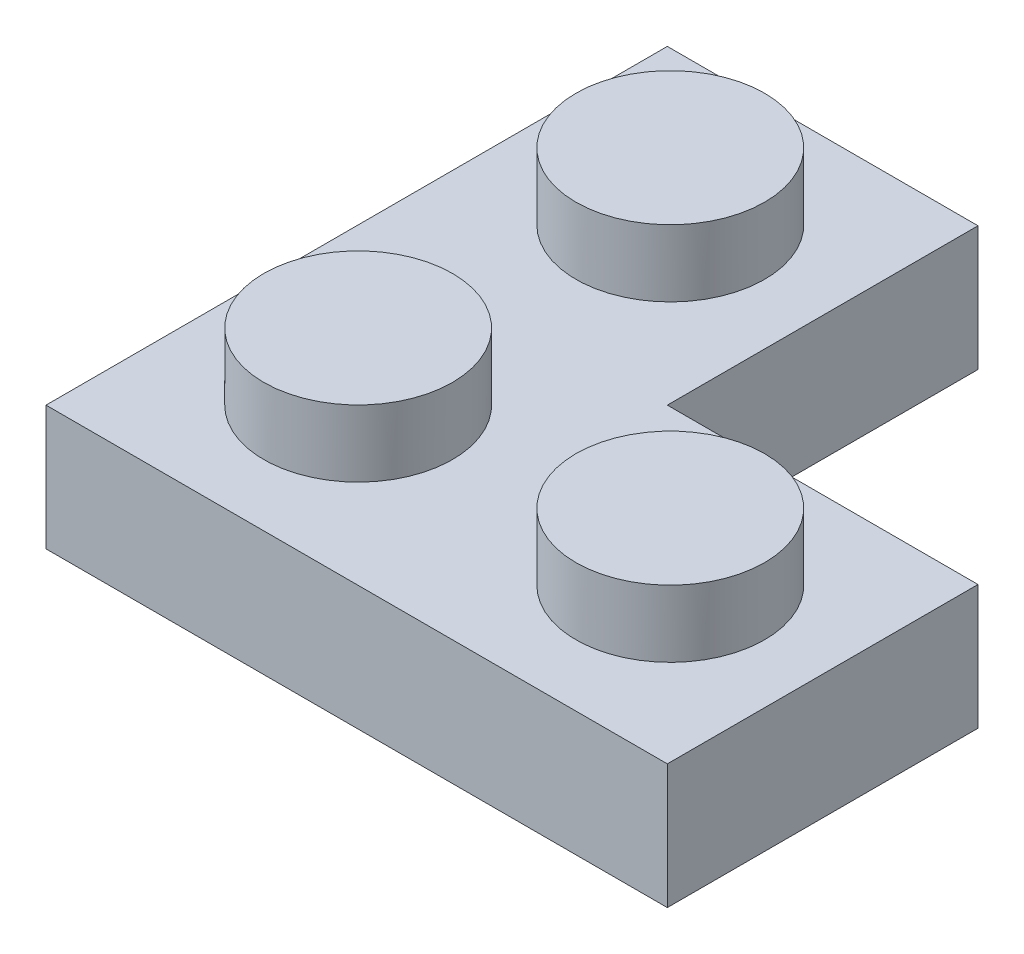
ISO-10303-21;
HEADER;
FILE_DESCRIPTION(('STEP AP214'),'2;1');
FILE_NAME('part.step','',(''),(''),'','','');
FILE_SCHEMA(('AUTOMOTIVE_DESIGN { 1 0 10303 214 1 1 1 1 }'));
ENDSEC;
DATA;
#1=APPLICATION_CONTEXT('core data for automotive mechanical design processes');
#2=APPLICATION_PROTOCOL_DEFINITION('international standard','automotive_design',2000,#1);
#3=PRODUCT_CONTEXT('',#1,'mechanical');
#4=PRODUCT('Part','Part','',(#3));
#5=PRODUCT_RELATED_PRODUCT_CATEGORY('part','',(#4));
#6=PRODUCT_DEFINITION_FORMATION('','',#4);
#7=PRODUCT_DEFINITION_CONTEXT('part definition',#1,'design');
#8=PRODUCT_DEFINITION('design','',#6,#7);
#9=PRODUCT_DEFINITION_SHAPE('','',#8);
#10=(LENGTH_UNIT() NAMED_UNIT(*) SI_UNIT(.MILLI.,.METRE.));
#11=(NAMED_UNIT(*) PLANE_ANGLE_UNIT() SI_UNIT($,.RADIAN.));
#12=(NAMED_UNIT(*) SI_UNIT($,.STERADIAN.) SOLID_ANGLE_UNIT());
#13=UNCERTAINTY_MEASURE_WITH_UNIT(LENGTH_MEASURE(1.E-05),#10,'distance_accuracy_value','');
#14=(GEOMETRIC_REPRESENTATION_CONTEXT(3) GLOBAL_UNCERTAINTY_ASSIGNED_CONTEXT((#13)) GLOBAL_UNIT_ASSIGNED_CONTEXT((#10,
#11,#12)) REPRESENTATION_CONTEXT('',''));
#15=CARTESIAN_POINT('',(0.,0.,0.));
#16=DIRECTION('',(0.,0.,1.));
#17=DIRECTION('',(1.,0.,0.));
#18=AXIS2_PLACEMENT_3D('',#15,#16,#17);
#19=CARTESIAN_POINT('',(-7.9,1.5785,7.9));
#20=DIRECTION('',(0.,-1.,0.));
#21=DIRECTION('',(0.,0.,-1.));
#22=AXIS2_PLACEMENT_3D('',#19,#20,#21);
#23=PLANE('',#22);
#24=CARTESIAN_POINT('',(-3.81000000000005,1.5785,0.));
#25=DIRECTION('',(0.,-1.,0.));
#26=DIRECTION('',(0.,0.,-1.));
#27=AXIS2_PLACEMENT_3D('',#24,#25,#26);
#28=CIRCLE('',#27,1.27);
#29=CARTESIAN_POINT('',(-3.81000000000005,1.5785,-1.27));
#30=VERTEX_POINT('',#29);
#31=EDGE_CURVE('E396',#30,#30,#28,.T.);
#32=ORIENTED_EDGE('',*,*,#31,.F.);
#33=EDGE_LOOP('',(#32));
#34=FACE_BOUND('',#33,.T.);
#35=CARTESIAN_POINT('',(-3.93125,1.5785,-4.00625));
#36=DIRECTION('',(0.,-1.,0.));
#37=DIRECTION('',(0.,0.,-1.));
#38=AXIS2_PLACEMENT_3D('',#35,#36,#37);
#39=CIRCLE('',#38,0.812499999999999);
#40=CARTESIAN_POINT('',(-3.93125,1.5785,-4.81875));
#41=VERTEX_POINT('',#40);
#42=EDGE_CURVE('E180',#41,#41,#39,.F.);
#43=ORIENTED_EDGE('',*,*,#42,.T.);
#44=EDGE_LOOP('',(#43));
#45=FACE_BOUND('',#44,.T.);
#46=CARTESIAN_POINT('',(4.00625,1.5785,3.93125));
#47=DIRECTION('',(0.,-1.,0.));
#48=DIRECTION('',(0.,0.,-1.));
#49=AXIS2_PLACEMENT_3D('',#46,#47,#48);
#50=CIRCLE('',#49,0.812499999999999);
#51=CARTESIAN_POINT('',(4.00625,1.5785,3.11875000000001));
#52=VERTEX_POINT('',#51);
#53=EDGE_CURVE('E402',#52,#52,#50,.F.);
#54=ORIENTED_EDGE('',*,*,#53,.T.);
#55=EDGE_LOOP('',(#54));
#56=FACE_BOUND('',#55,.T.);
#57=CARTESIAN_POINT('',(-3.93125,1.5785,3.93125));
#58=DIRECTION('',(0.,-1.,0.));
#59=DIRECTION('',(0.,0.,-1.));
#60=AXIS2_PLACEMENT_3D('',#57,#58,#59);
#61=CIRCLE('',#60,0.812499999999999);
#62=CARTESIAN_POINT('',(-3.93125,1.5785,3.11875000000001));
#63=VERTEX_POINT('',#62);
#64=EDGE_CURVE('E168',#63,#63,#61,.F.);
#65=ORIENTED_EDGE('',*,*,#64,.T.);
#66=EDGE_LOOP('',(#65));
#67=FACE_BOUND('',#66,.T.);
#68=DIRECTION('',(0.,0.,1.));
#69=VECTOR('',#68,1.);
#70=CARTESIAN_POINT('',(-1.5875,1.5785,7.9));
#71=LINE('',#70,#69);
#72=CARTESIAN_POINT('',(-1.5875,1.5785,-6.3125));
#73=VERTEX_POINT('',#72);
#74=CARTESIAN_POINT('',(-1.5875,1.5785,1.5875));
#75=VERTEX_POINT('',#74);
#76=EDGE_CURVE('E129',#73,#75,#71,.T.);
#77=ORIENTED_EDGE('',*,*,#76,.T.);
#78=DIRECTION('',(1.,0.,0.));
#79=VECTOR('',#78,1.);
#80=CARTESIAN_POINT('',(-7.9,1.5785,1.5875));
#81=LINE('',#80,#79);
#82=CARTESIAN_POINT('',(6.3125,1.5785,1.5875));
#83=VERTEX_POINT('',#82);
#84=EDGE_CURVE('E134',#75,#83,#81,.T.);
#85=ORIENTED_EDGE('',*,*,#84,.T.);
#86=DIRECTION('',(0.,0.,-1.));
#87=VECTOR('',#86,1.);
#88=CARTESIAN_POINT('',(6.3125,1.5785,7.9));
#89=LINE('',#88,#87);
#90=CARTESIAN_POINT('',(6.3125,1.5785,6.3125));
#91=VERTEX_POINT('',#90);
#92=EDGE_CURVE('E160',#91,#83,#89,.T.);
#93=ORIENTED_EDGE('',*,*,#92,.F.);
#94=DIRECTION('',(-1.,0.,0.));
#95=VECTOR('',#94,1.);
#96=CARTESIAN_POINT('',(-7.9,1.5785,6.3125));
#97=LINE('',#96,#95);
#98=CARTESIAN_POINT('',(-6.3125,1.5785,6.3125));
#99=VERTEX_POINT('',#98);
#100=EDGE_CURVE('E408',#91,#99,#97,.T.);
#101=ORIENTED_EDGE('',*,*,#100,.T.);
#102=DIRECTION('',(0.,0.,1.));
#103=VECTOR('',#102,1.);
#104=CARTESIAN_POINT('',(-6.3125,1.5785,7.9));
#105=LINE('',#104,#103);
#106=CARTESIAN_POINT('',(-6.3125,1.5785,-6.3125));
#107=VERTEX_POINT('',#106);
#108=EDGE_CURVE('E190',#107,#99,#105,.T.);
#109=ORIENTED_EDGE('',*,*,#108,.F.);
#110=DIRECTION('',(1.,0.,0.));
#111=VECTOR('',#110,1.);
#112=CARTESIAN_POINT('',(-7.9,1.5785,-6.3125));
#113=LINE('',#112,#111);
#114=EDGE_CURVE('E138',#107,#73,#113,.T.);
#115=ORIENTED_EDGE('',*,*,#114,.T.);
#116=EDGE_LOOP('',(#77,#85,#93,#101,#109,#115));
#117=FACE_BOUND('',#116,.T.);
#118=CARTESIAN_POINT('',(0.,1.5785,3.80999999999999));
#119=DIRECTION('',(0.,-1.,0.));
#120=DIRECTION('',(0.,0.,-1.));
#121=AXIS2_PLACEMENT_3D('',#118,#119,#120);
#122=CIRCLE('',#121,1.27);
#123=CARTESIAN_POINT('',(0.,1.5785,2.53999999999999));
#124=VERTEX_POINT('',#123);
#125=EDGE_CURVE('E390',#124,#124,#122,.T.);
#126=ORIENTED_EDGE('',*,*,#125,.F.);
#127=EDGE_LOOP('',(#126));
#128=FACE_BOUND('',#127,.T.);
#129=ADVANCED_FACE('F39',(#34,#45,#56,#67,#117,#128),#23,.T.);
#130=CARTESIAN_POINT('',(-7.9,3.166,7.9));
#131=DIRECTION('',(0.,-1.,0.));
#132=DIRECTION('',(0.,0.,-1.));
#133=AXIS2_PLACEMENT_3D('',#130,#131,#132);
#134=PLANE('',#133);
#135=CARTESIAN_POINT('',(-3.93125,3.166,-4.00625));
#136=DIRECTION('',(0.,-1.,0.));
#137=DIRECTION('',(0.,0.,-1.));
#138=AXIS2_PLACEMENT_3D('',#135,#136,#137);
#139=CIRCLE('',#138,2.4);
#140=CARTESIAN_POINT('',(-3.93125,3.166,-6.40625));
#141=VERTEX_POINT('',#140);
#142=EDGE_CURVE('E245',#141,#141,#139,.F.);
#143=ORIENTED_EDGE('',*,*,#142,.F.);
#144=EDGE_LOOP('',(#143));
#145=FACE_BOUND('',#144,.T.);
#146=CARTESIAN_POINT('',(4.00625,3.166,3.93125));
#147=DIRECTION('',(0.,-1.,0.));
#148=DIRECTION('',(0.,0.,-1.));
#149=AXIS2_PLACEMENT_3D('',#146,#147,#148);
#150=CIRCLE('',#149,2.4);
#151=CARTESIAN_POINT('',(4.00625,3.166,1.53125000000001));
#152=VERTEX_POINT('',#151);
#153=EDGE_CURVE('E242',#152,#152,#150,.F.);
#154=ORIENTED_EDGE('',*,*,#153,.F.);
#155=EDGE_LOOP('',(#154));
#156=FACE_BOUND('',#155,.T.);
#157=CARTESIAN_POINT('',(-3.93125,3.166,3.93125));
#158=DIRECTION('',(0.,-1.,0.));
#159=DIRECTION('',(0.,0.,-1.));
#160=AXIS2_PLACEMENT_3D('',#157,#158,#159);
#161=CIRCLE('',#160,2.4);
#162=CARTESIAN_POINT('',(-3.93125,3.166,1.53125000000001));
#163=VERTEX_POINT('',#162);
#164=EDGE_CURVE('E239',#163,#163,#161,.F.);
#165=ORIENTED_EDGE('',*,*,#164,.F.);
#166=EDGE_LOOP('',(#165));
#167=FACE_BOUND('',#166,.T.);
#168=DIRECTION('',(0.,0.,1.));
#169=VECTOR('',#168,1.);
#170=CARTESIAN_POINT('',(0.,3.166,7.9));
#171=LINE('',#170,#169);
#172=CARTESIAN_POINT('',(0.,3.166,-7.89999999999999));
#173=VERTEX_POINT('',#172);
#174=CARTESIAN_POINT('',(0.,3.166,0.));
#175=VERTEX_POINT('',#174);
#176=EDGE_CURVE('E202',#173,#175,#171,.T.);
#177=ORIENTED_EDGE('',*,*,#176,.F.);
#178=DIRECTION('',(1.,0.,0.));
#179=VECTOR('',#178,1.);
#180=CARTESIAN_POINT('',(-7.9,3.166,-7.9));
#181=LINE('',#180,#179);
#182=CARTESIAN_POINT('',(-7.9,3.166,-7.9));
#183=VERTEX_POINT('',#182);
#184=EDGE_CURVE('E220',#183,#173,#181,.T.);
#185=ORIENTED_EDGE('',*,*,#184,.F.);
#186=DIRECTION('',(0.,0.,1.));
#187=VECTOR('',#186,1.);
#188=CARTESIAN_POINT('',(-7.9,3.166,-7.9));
#189=LINE('',#188,#187);
#190=CARTESIAN_POINT('',(-7.9,3.166,7.9));
#191=VERTEX_POINT('',#190);
#192=EDGE_CURVE('E211',#183,#191,#189,.T.);
#193=ORIENTED_EDGE('',*,*,#192,.T.);
#194=DIRECTION('',(-1.,0.,0.));
#195=VECTOR('',#194,1.);
#196=CARTESIAN_POINT('',(7.9,3.166,7.9));
#197=LINE('',#196,#195);
#198=CARTESIAN_POINT('',(7.9,3.166,7.9));
#199=VERTEX_POINT('',#198);
#200=EDGE_CURVE('E213',#199,#191,#197,.T.);
#201=ORIENTED_EDGE('',*,*,#200,.F.);
#202=DIRECTION('',(0.,0.,-1.));
#203=VECTOR('',#202,1.);
#204=CARTESIAN_POINT('',(7.9,3.166,7.9));
#205=LINE('',#204,#203);
#206=CARTESIAN_POINT('',(7.9,3.166,0.));
#207=VERTEX_POINT('',#206);
#208=EDGE_CURVE('E217',#199,#207,#205,.T.);
#209=ORIENTED_EDGE('',*,*,#208,.T.);
#210=DIRECTION('',(1.,0.,0.));
#211=VECTOR('',#210,1.);
#212=CARTESIAN_POINT('',(-7.9,3.166,0.));
#213=LINE('',#212,#211);
#214=EDGE_CURVE('E200',#175,#207,#213,.T.);
#215=ORIENTED_EDGE('',*,*,#214,.F.);
#216=EDGE_LOOP('',(#177,#185,#193,#201,#209,#215));
#217=FACE_BOUND('',#216,.T.);
#218=ADVANCED_FACE('F274',(#145,#156,#167,#217),#134,.F.);
#219=CARTESIAN_POINT('',(7.9,3.166,7.9));
#220=DIRECTION('',(-1.,0.,0.));
#221=DIRECTION('',(0.,0.,1.));
#222=AXIS2_PLACEMENT_3D('',#219,#220,#221);
#223=PLANE('',#222);
#224=DIRECTION('',(0.,-1.,0.));
#225=VECTOR('',#224,1.);
#226=CARTESIAN_POINT('',(7.9,31.7513425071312,0.));
#227=LINE('',#226,#225);
#228=CARTESIAN_POINT('',(7.9,0.,0.));
#229=VERTEX_POINT('',#228);
#230=EDGE_CURVE('E62',#207,#229,#227,.T.);
#231=ORIENTED_EDGE('',*,*,#230,.F.);
#232=ORIENTED_EDGE('',*,*,#208,.F.);
#233=DIRECTION('',(0.,-1.,0.));
#234=VECTOR('',#233,1.);
#235=CARTESIAN_POINT('',(7.9,3.166,7.9));
#236=LINE('',#235,#234);
#237=CARTESIAN_POINT('',(7.9,0.,7.9));
#238=VERTEX_POINT('',#237);
#239=EDGE_CURVE('E235',#199,#238,#236,.T.);
#240=ORIENTED_EDGE('',*,*,#239,.T.);
#241=DIRECTION('',(0.,0.,-1.));
#242=VECTOR('',#241,1.);
#243=CARTESIAN_POINT('',(7.9,0.,7.9));
#244=LINE('',#243,#242);
#245=EDGE_CURVE('E229',#238,#229,#244,.T.);
#246=ORIENTED_EDGE('',*,*,#245,.T.);
#247=EDGE_LOOP('',(#231,#232,#240,#246));
#248=FACE_BOUND('',#247,.T.);
#249=ADVANCED_FACE('F256',(#248),#223,.F.);
#250=CARTESIAN_POINT('',(-7.9,3.166,-7.9));
#251=DIRECTION('',(0.,0.,-1.));
#252=DIRECTION('',(-1.,0.,0.));
#253=AXIS2_PLACEMENT_3D('',#250,#251,#252);
#254=PLANE('',#253);
#255=ORIENTED_EDGE('',*,*,#184,.T.);
#256=DIRECTION('',(0.,-1.,0.));
#257=VECTOR('',#256,1.);
#258=CARTESIAN_POINT('',(0.,31.7513425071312,-7.89999999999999));
#259=LINE('',#258,#257);
#260=CARTESIAN_POINT('',(0.,0.,-7.89999999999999));
#261=VERTEX_POINT('',#260);
#262=EDGE_CURVE('E195',#173,#261,#259,.T.);
#263=ORIENTED_EDGE('',*,*,#262,.T.);
#264=DIRECTION('',(1.,0.,0.));
#265=VECTOR('',#264,1.);
#266=CARTESIAN_POINT('',(-7.9,0.,-7.9));
#267=LINE('',#266,#265);
#268=CARTESIAN_POINT('',(-7.9,0.,-7.9));
#269=VERTEX_POINT('',#268);
#270=EDGE_CURVE('E214',#269,#261,#267,.T.);
#271=ORIENTED_EDGE('',*,*,#270,.F.);
#272=DIRECTION('',(0.,-1.,0.));
#273=VECTOR('',#272,1.);
#274=CARTESIAN_POINT('',(-7.9,3.166,-7.9));
#275=LINE('',#274,#273);
#276=EDGE_CURVE('E223',#183,#269,#275,.T.);
#277=ORIENTED_EDGE('',*,*,#276,.F.);
#278=EDGE_LOOP('',(#255,#263,#271,#277));
#279=FACE_BOUND('',#278,.T.);
#280=ADVANCED_FACE('F266',(#279),#254,.T.);
#281=CARTESIAN_POINT('',(-7.9,0.,7.9));
#282=DIRECTION('',(0.,-1.,0.));
#283=DIRECTION('',(0.,0.,-1.));
#284=AXIS2_PLACEMENT_3D('',#281,#282,#283);
#285=PLANE('',#284);
#286=DIRECTION('',(1.,0.,0.));
#287=VECTOR('',#286,1.);
#288=CARTESIAN_POINT('',(-7.9,0.,-6.3125));
#289=LINE('',#288,#287);
#290=CARTESIAN_POINT('',(-6.3125,0.,-6.3125));
#291=VERTEX_POINT('',#290);
#292=CARTESIAN_POINT('',(-1.5875,0.,-6.3125));
#293=VERTEX_POINT('',#292);
#294=EDGE_CURVE('E184',#291,#293,#289,.T.);
#295=ORIENTED_EDGE('',*,*,#294,.F.);
#296=DIRECTION('',(0.,0.,1.));
#297=VECTOR('',#296,1.);
#298=CARTESIAN_POINT('',(-6.3125,0.,7.9));
#299=LINE('',#298,#297);
#300=CARTESIAN_POINT('',(-6.3125,0.,6.3125));
#301=VERTEX_POINT('',#300);
#302=EDGE_CURVE('E173',#291,#301,#299,.T.);
#303=ORIENTED_EDGE('',*,*,#302,.T.);
#304=DIRECTION('',(-1.,0.,0.));
#305=VECTOR('',#304,1.);
#306=CARTESIAN_POINT('',(-7.9,0.,6.3125));
#307=LINE('',#306,#305);
#308=CARTESIAN_POINT('',(6.3125,0.,6.3125));
#309=VERTEX_POINT('',#308);
#310=EDGE_CURVE('E54',#309,#301,#307,.T.);
#311=ORIENTED_EDGE('',*,*,#310,.F.);
#312=DIRECTION('',(0.,0.,-1.));
#313=VECTOR('',#312,1.);
#314=CARTESIAN_POINT('',(6.3125,0.,7.9));
#315=LINE('',#314,#313);
#316=CARTESIAN_POINT('',(6.3125,0.,1.5875));
#317=VERTEX_POINT('',#316);
#318=EDGE_CURVE('E181',#309,#317,#315,.T.);
#319=ORIENTED_EDGE('',*,*,#318,.T.);
#320=DIRECTION('',(1.,0.,0.));
#321=VECTOR('',#320,1.);
#322=CARTESIAN_POINT('',(-7.9,0.,1.5875));
#323=LINE('',#322,#321);
#324=CARTESIAN_POINT('',(-1.5875,0.,1.5875));
#325=VERTEX_POINT('',#324);
#326=EDGE_CURVE('E179',#325,#317,#323,.T.);
#327=ORIENTED_EDGE('',*,*,#326,.F.);
#328=DIRECTION('',(0.,0.,1.));
#329=VECTOR('',#328,1.);
#330=CARTESIAN_POINT('',(-1.5875,0.,7.9));
#331=LINE('',#330,#329);
#332=EDGE_CURVE('E146',#293,#325,#331,.T.);
#333=ORIENTED_EDGE('',*,*,#332,.F.);
#334=EDGE_LOOP('',(#295,#303,#311,#319,#327,#333));
#335=FACE_BOUND('',#334,.T.);
#336=ORIENTED_EDGE('',*,*,#270,.T.);
#337=DIRECTION('',(0.,0.,1.));
#338=VECTOR('',#337,1.);
#339=CARTESIAN_POINT('',(0.,0.,7.9));
#340=LINE('',#339,#338);
#341=CARTESIAN_POINT('',(0.,0.,0.));
#342=VERTEX_POINT('',#341);
#343=EDGE_CURVE('E11',#261,#342,#340,.T.);
#344=ORIENTED_EDGE('',*,*,#343,.T.);
#345=DIRECTION('',(1.,0.,0.));
#346=VECTOR('',#345,1.);
#347=CARTESIAN_POINT('',(-7.9,0.,0.));
#348=LINE('',#347,#346);
#349=EDGE_CURVE('E47',#342,#229,#348,.T.);
#350=ORIENTED_EDGE('',*,*,#349,.T.);
#351=ORIENTED_EDGE('',*,*,#245,.F.);
#352=DIRECTION('',(-1.,0.,0.));
#353=VECTOR('',#352,1.);
#354=CARTESIAN_POINT('',(7.9,0.,7.9));
#355=LINE('',#354,#353);
#356=CARTESIAN_POINT('',(-7.9,0.,7.9));
#357=VERTEX_POINT('',#356);
#358=EDGE_CURVE('E226',#238,#357,#355,.T.);
#359=ORIENTED_EDGE('',*,*,#358,.T.);
#360=DIRECTION('',(0.,0.,1.));
#361=VECTOR('',#360,1.);
#362=CARTESIAN_POINT('',(-7.9,0.,-7.9));
#363=LINE('',#362,#361);
#364=EDGE_CURVE('E210',#269,#357,#363,.T.);
#365=ORIENTED_EDGE('',*,*,#364,.F.);
#366=EDGE_LOOP('',(#336,#344,#350,#351,#359,#365));
#367=FACE_BOUND('',#366,.T.);
#368=ADVANCED_FACE('F252',(#335,#367),#285,.T.);
#369=CARTESIAN_POINT('',(-7.9,3.166,-7.9));
#370=DIRECTION('',(1.,0.,0.));
#371=DIRECTION('',(0.,0.,-1.));
#372=AXIS2_PLACEMENT_3D('',#369,#370,#371);
#373=PLANE('',#372);
#374=ORIENTED_EDGE('',*,*,#364,.T.);
#375=DIRECTION('',(0.,-1.,0.));
#376=VECTOR('',#375,1.);
#377=CARTESIAN_POINT('',(-7.9,3.166,7.9));
#378=LINE('',#377,#376);
#379=EDGE_CURVE('E237',#191,#357,#378,.T.);
#380=ORIENTED_EDGE('',*,*,#379,.F.);
#381=ORIENTED_EDGE('',*,*,#192,.F.);
#382=ORIENTED_EDGE('',*,*,#276,.T.);
#383=EDGE_LOOP('',(#374,#380,#381,#382));
#384=FACE_BOUND('',#383,.T.);
#385=ADVANCED_FACE('F416',(#384),#373,.F.);
#386=CARTESIAN_POINT('',(7.9,3.166,7.9));
#387=DIRECTION('',(0.,0.,1.));
#388=DIRECTION('',(1.,0.,0.));
#389=AXIS2_PLACEMENT_3D('',#386,#387,#388);
#390=PLANE('',#389);
#391=ORIENTED_EDGE('',*,*,#358,.F.);
#392=ORIENTED_EDGE('',*,*,#239,.F.);
#393=ORIENTED_EDGE('',*,*,#200,.T.);
#394=ORIENTED_EDGE('',*,*,#379,.T.);
#395=EDGE_LOOP('',(#391,#392,#393,#394));
#396=FACE_BOUND('',#395,.T.);
#397=ADVANCED_FACE('F260',(#396),#390,.T.);
#398=CARTESIAN_POINT('',(-3.93125,4.866,3.93125));
#399=DIRECTION('',(0.,-1.,0.));
#400=DIRECTION('',(0.,0.,-1.));
#401=AXIS2_PLACEMENT_3D('',#398,#399,#400);
#402=CYLINDRICAL_SURFACE('',#401,2.4);
#403=CARTESIAN_POINT('',(-3.93125,4.866,3.93125));
#404=DIRECTION('',(0.,1.,0.));
#405=DIRECTION('',(0.,0.,1.));
#406=AXIS2_PLACEMENT_3D('',#403,#404,#405);
#407=CIRCLE('',#406,2.4);
#408=CARTESIAN_POINT('',(-3.93125,4.866,6.33125));
#409=VERTEX_POINT('',#408);
#410=EDGE_CURVE('E207',#409,#409,#407,.T.);
#411=ORIENTED_EDGE('',*,*,#410,.F.);
#412=EDGE_LOOP('',(#411));
#413=FACE_BOUND('',#412,.T.);
#414=ORIENTED_EDGE('',*,*,#164,.T.);
#415=EDGE_LOOP('',(#414));
#416=FACE_BOUND('',#415,.T.);
#417=ADVANCED_FACE('F429',(#413,#416),#402,.T.);
#418=CARTESIAN_POINT('',(-3.93125,4.866,3.93125));
#419=DIRECTION('',(0.,1.,0.));
#420=DIRECTION('',(0.,0.,1.));
#421=AXIS2_PLACEMENT_3D('',#418,#419,#420);
#422=PLANE('',#421);
#423=ORIENTED_EDGE('',*,*,#410,.T.);
#424=EDGE_LOOP('',(#423));
#425=FACE_BOUND('',#424,.T.);
#426=ADVANCED_FACE('F447',(#425),#422,.T.);
#427=CARTESIAN_POINT('',(4.00625,4.866,3.93125));
#428=DIRECTION('',(0.,-1.,0.));
#429=DIRECTION('',(0.,0.,-1.));
#430=AXIS2_PLACEMENT_3D('',#427,#428,#429);
#431=CYLINDRICAL_SURFACE('',#430,2.4);
#432=CARTESIAN_POINT('',(4.00625,4.866,3.93125));
#433=DIRECTION('',(0.,1.,0.));
#434=DIRECTION('',(0.,0.,1.));
#435=AXIS2_PLACEMENT_3D('',#432,#433,#434);
#436=CIRCLE('',#435,2.4);
#437=CARTESIAN_POINT('',(4.00625,4.866,6.33125));
#438=VERTEX_POINT('',#437);
#439=EDGE_CURVE('E204',#438,#438,#436,.T.);
#440=ORIENTED_EDGE('',*,*,#439,.F.);
#441=EDGE_LOOP('',(#440));
#442=FACE_BOUND('',#441,.T.);
#443=ORIENTED_EDGE('',*,*,#153,.T.);
#444=EDGE_LOOP('',(#443));
#445=FACE_BOUND('',#444,.T.);
#446=ADVANCED_FACE('F437',(#442,#445),#431,.T.);
#447=CARTESIAN_POINT('',(4.00625,4.866,3.93125));
#448=DIRECTION('',(0.,1.,0.));
#449=DIRECTION('',(0.,0.,1.));
#450=AXIS2_PLACEMENT_3D('',#447,#448,#449);
#451=PLANE('',#450);
#452=ORIENTED_EDGE('',*,*,#439,.T.);
#453=EDGE_LOOP('',(#452));
#454=FACE_BOUND('',#453,.T.);
#455=ADVANCED_FACE('F435',(#454),#451,.T.);
#456=CARTESIAN_POINT('',(-3.93125,4.866,-4.00625));
#457=DIRECTION('',(0.,1.,0.));
#458=DIRECTION('',(0.,0.,1.));
#459=AXIS2_PLACEMENT_3D('',#456,#457,#458);
#460=PLANE('',#459);
#461=CARTESIAN_POINT('',(-3.93125,4.866,-4.00625));
#462=DIRECTION('',(0.,1.,0.));
#463=DIRECTION('',(0.,0.,1.));
#464=AXIS2_PLACEMENT_3D('',#461,#462,#463);
#465=CIRCLE('',#464,2.4);
#466=CARTESIAN_POINT('',(-3.93125,4.866,-1.60625));
#467=VERTEX_POINT('',#466);
#468=EDGE_CURVE('E248',#467,#467,#465,.T.);
#469=ORIENTED_EDGE('',*,*,#468,.T.);
#470=EDGE_LOOP('',(#469));
#471=FACE_BOUND('',#470,.T.);
#472=ADVANCED_FACE('F41',(#471),#460,.T.);
#473=CARTESIAN_POINT('',(-3.93125,4.866,-4.00625));
#474=DIRECTION('',(0.,-1.,0.));
#475=DIRECTION('',(0.,0.,-1.));
#476=AXIS2_PLACEMENT_3D('',#473,#474,#475);
#477=CYLINDRICAL_SURFACE('',#476,2.4);
#478=ORIENTED_EDGE('',*,*,#468,.F.);
#479=EDGE_LOOP('',(#478));
#480=FACE_BOUND('',#479,.T.);
#481=ORIENTED_EDGE('',*,*,#142,.T.);
#482=EDGE_LOOP('',(#481));
#483=FACE_BOUND('',#482,.T.);
#484=ADVANCED_FACE('F286',(#480,#483),#477,.T.);
#485=CARTESIAN_POINT('',(0.,31.7513425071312,-7.89999999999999));
#486=DIRECTION('',(1.,0.,0.));
#487=DIRECTION('',(0.,0.,-1.));
#488=AXIS2_PLACEMENT_3D('',#485,#486,#487);
#489=PLANE('',#488);
#490=ORIENTED_EDGE('',*,*,#262,.F.);
#491=ORIENTED_EDGE('',*,*,#176,.T.);
#492=DIRECTION('',(0.,-1.,0.));
#493=VECTOR('',#492,1.);
#494=CARTESIAN_POINT('',(0.,31.7513425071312,0.));
#495=LINE('',#494,#493);
#496=EDGE_CURVE('E192',#175,#342,#495,.T.);
#497=ORIENTED_EDGE('',*,*,#496,.T.);
#498=ORIENTED_EDGE('',*,*,#343,.F.);
#499=EDGE_LOOP('',(#490,#491,#497,#498));
#500=FACE_BOUND('',#499,.T.);
#501=ADVANCED_FACE('F271',(#500),#489,.T.);
#502=CARTESIAN_POINT('',(0.,31.7513425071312,0.));
#503=DIRECTION('',(0.,0.,-1.));
#504=DIRECTION('',(-1.,0.,0.));
#505=AXIS2_PLACEMENT_3D('',#502,#503,#504);
#506=PLANE('',#505);
#507=ORIENTED_EDGE('',*,*,#496,.F.);
#508=ORIENTED_EDGE('',*,*,#214,.T.);
#509=ORIENTED_EDGE('',*,*,#230,.T.);
#510=ORIENTED_EDGE('',*,*,#349,.F.);
#511=EDGE_LOOP('',(#507,#508,#509,#510));
#512=FACE_BOUND('',#511,.T.);
#513=ADVANCED_FACE('F275',(#512),#506,.T.);
#514=CARTESIAN_POINT('',(6.3125,3.166,7.9));
#515=DIRECTION('',(-1.,0.,0.));
#516=DIRECTION('',(0.,0.,1.));
#517=AXIS2_PLACEMENT_3D('',#514,#515,#516);
#518=PLANE('',#517);
#519=DIRECTION('',(0.,-1.,0.));
#520=VECTOR('',#519,1.);
#521=CARTESIAN_POINT('',(6.3125,3.166,1.5875));
#522=LINE('',#521,#520);
#523=EDGE_CURVE('E150',#83,#317,#522,.T.);
#524=ORIENTED_EDGE('',*,*,#523,.T.);
#525=ORIENTED_EDGE('',*,*,#318,.F.);
#526=DIRECTION('',(0.,-1.,0.));
#527=VECTOR('',#526,1.);
#528=CARTESIAN_POINT('',(6.3125,3.166,6.3125));
#529=LINE('',#528,#527);
#530=EDGE_CURVE('E163',#91,#309,#529,.T.);
#531=ORIENTED_EDGE('',*,*,#530,.F.);
#532=ORIENTED_EDGE('',*,*,#92,.T.);
#533=EDGE_LOOP('',(#524,#525,#531,#532));
#534=FACE_BOUND('',#533,.T.);
#535=ADVANCED_FACE('F277',(#534),#518,.T.);
#536=CARTESIAN_POINT('',(-7.9,3.166,-6.3125));
#537=DIRECTION('',(0.,0.,-1.));
#538=DIRECTION('',(-1.,0.,0.));
#539=AXIS2_PLACEMENT_3D('',#536,#537,#538);
#540=PLANE('',#539);
#541=ORIENTED_EDGE('',*,*,#114,.F.);
#542=DIRECTION('',(0.,-1.,0.));
#543=VECTOR('',#542,1.);
#544=CARTESIAN_POINT('',(-6.3125,3.166,-6.3125));
#545=LINE('',#544,#543);
#546=EDGE_CURVE('E166',#107,#291,#545,.T.);
#547=ORIENTED_EDGE('',*,*,#546,.T.);
#548=ORIENTED_EDGE('',*,*,#294,.T.);
#549=DIRECTION('',(0.,-1.,0.));
#550=VECTOR('',#549,1.);
#551=CARTESIAN_POINT('',(-1.5875,3.166,-6.3125));
#552=LINE('',#551,#550);
#553=EDGE_CURVE('E155',#73,#293,#552,.T.);
#554=ORIENTED_EDGE('',*,*,#553,.F.);
#555=EDGE_LOOP('',(#541,#547,#548,#554));
#556=FACE_BOUND('',#555,.T.);
#557=ADVANCED_FACE('F283',(#556),#540,.F.);
#558=CARTESIAN_POINT('',(-6.3125,3.166,-7.9));
#559=DIRECTION('',(1.,0.,0.));
#560=DIRECTION('',(0.,0.,-1.));
#561=AXIS2_PLACEMENT_3D('',#558,#559,#560);
#562=PLANE('',#561);
#563=ORIENTED_EDGE('',*,*,#302,.F.);
#564=ORIENTED_EDGE('',*,*,#546,.F.);
#565=ORIENTED_EDGE('',*,*,#108,.T.);
#566=DIRECTION('',(0.,-1.,0.));
#567=VECTOR('',#566,1.);
#568=CARTESIAN_POINT('',(-6.3125,3.166,6.3125));
#569=LINE('',#568,#567);
#570=EDGE_CURVE('E165',#99,#301,#569,.T.);
#571=ORIENTED_EDGE('',*,*,#570,.T.);
#572=EDGE_LOOP('',(#563,#564,#565,#571));
#573=FACE_BOUND('',#572,.T.);
#574=ADVANCED_FACE('F305',(#573),#562,.T.);
#575=CARTESIAN_POINT('',(7.9,3.166,6.3125));
#576=DIRECTION('',(0.,0.,1.));
#577=DIRECTION('',(1.,0.,0.));
#578=AXIS2_PLACEMENT_3D('',#575,#576,#577);
#579=PLANE('',#578);
#580=ORIENTED_EDGE('',*,*,#310,.T.);
#581=ORIENTED_EDGE('',*,*,#570,.F.);
#582=ORIENTED_EDGE('',*,*,#100,.F.);
#583=ORIENTED_EDGE('',*,*,#530,.T.);
#584=EDGE_LOOP('',(#580,#581,#582,#583));
#585=FACE_BOUND('',#584,.T.);
#586=ADVANCED_FACE('F309',(#585),#579,.F.);
#587=CARTESIAN_POINT('',(-3.93125,4.866,3.93125));
#588=DIRECTION('',(0.,-1.,0.));
#589=DIRECTION('',(0.,0.,-1.));
#590=AXIS2_PLACEMENT_3D('',#587,#588,#589);
#591=CYLINDRICAL_SURFACE('',#590,0.812499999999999);
#592=CARTESIAN_POINT('',(-3.93125,3.2785,3.93125));
#593=DIRECTION('',(0.,1.,0.));
#594=DIRECTION('',(0.,0.,1.));
#595=AXIS2_PLACEMENT_3D('',#592,#593,#594);
#596=CIRCLE('',#595,0.812499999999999);
#597=CARTESIAN_POINT('',(-3.93125,3.2785,4.74375));
#598=VERTEX_POINT('',#597);
#599=EDGE_CURVE('E170',#598,#598,#596,.T.);
#600=ORIENTED_EDGE('',*,*,#599,.T.);
#601=EDGE_LOOP('',(#600));
#602=FACE_BOUND('',#601,.T.);
#603=ORIENTED_EDGE('',*,*,#64,.F.);
#604=EDGE_LOOP('',(#603));
#605=FACE_BOUND('',#604,.T.);
#606=ADVANCED_FACE('F313',(#602,#605),#591,.F.);
#607=CARTESIAN_POINT('',(-3.93125,3.2785,3.93125));
#608=DIRECTION('',(0.,1.,0.));
#609=DIRECTION('',(0.,0.,1.));
#610=AXIS2_PLACEMENT_3D('',#607,#608,#609);
#611=PLANE('',#610);
#612=ORIENTED_EDGE('',*,*,#599,.F.);
#613=EDGE_LOOP('',(#612));
#614=FACE_BOUND('',#613,.T.);
#615=ADVANCED_FACE('F316',(#614),#611,.F.);
#616=CARTESIAN_POINT('',(4.00625,4.866,3.93125));
#617=DIRECTION('',(0.,-1.,0.));
#618=DIRECTION('',(0.,0.,-1.));
#619=AXIS2_PLACEMENT_3D('',#616,#617,#618);
#620=CYLINDRICAL_SURFACE('',#619,0.812499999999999);
#621=CARTESIAN_POINT('',(4.00625,3.2785,3.93125));
#622=DIRECTION('',(0.,1.,0.));
#623=DIRECTION('',(0.,0.,1.));
#624=AXIS2_PLACEMENT_3D('',#621,#622,#623);
#625=CIRCLE('',#624,0.812499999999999);
#626=CARTESIAN_POINT('',(4.00625,3.2785,4.74375));
#627=VERTEX_POINT('',#626);
#628=EDGE_CURVE('E140',#627,#627,#625,.T.);
#629=ORIENTED_EDGE('',*,*,#628,.T.);
#630=EDGE_LOOP('',(#629));
#631=FACE_BOUND('',#630,.T.);
#632=ORIENTED_EDGE('',*,*,#53,.F.);
#633=EDGE_LOOP('',(#632));
#634=FACE_BOUND('',#633,.T.);
#635=ADVANCED_FACE('F320',(#631,#634),#620,.F.);
#636=CARTESIAN_POINT('',(4.00625,3.2785,3.93125));
#637=DIRECTION('',(0.,1.,0.));
#638=DIRECTION('',(0.,0.,1.));
#639=AXIS2_PLACEMENT_3D('',#636,#637,#638);
#640=PLANE('',#639);
#641=ORIENTED_EDGE('',*,*,#628,.F.);
#642=EDGE_LOOP('',(#641));
#643=FACE_BOUND('',#642,.T.);
#644=ADVANCED_FACE('F322',(#643),#640,.F.);
#645=CARTESIAN_POINT('',(-3.93125,3.2785,-4.00625));
#646=DIRECTION('',(0.,1.,0.));
#647=DIRECTION('',(0.,0.,1.));
#648=AXIS2_PLACEMENT_3D('',#645,#646,#647);
#649=PLANE('',#648);
#650=CARTESIAN_POINT('',(-3.93125,3.2785,-4.00625));
#651=DIRECTION('',(0.,1.,0.));
#652=DIRECTION('',(0.,0.,1.));
#653=AXIS2_PLACEMENT_3D('',#650,#651,#652);
#654=CIRCLE('',#653,0.812499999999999);
#655=CARTESIAN_POINT('',(-3.93125,3.2785,-3.19375));
#656=VERTEX_POINT('',#655);
#657=EDGE_CURVE('E176',#656,#656,#654,.T.);
#658=ORIENTED_EDGE('',*,*,#657,.F.);
#659=EDGE_LOOP('',(#658));
#660=FACE_BOUND('',#659,.T.);
#661=ADVANCED_FACE('F326',(#660),#649,.F.);
#662=CARTESIAN_POINT('',(-3.93125,4.866,-4.00625));
#663=DIRECTION('',(0.,-1.,0.));
#664=DIRECTION('',(0.,0.,-1.));
#665=AXIS2_PLACEMENT_3D('',#662,#663,#664);
#666=CYLINDRICAL_SURFACE('',#665,0.812499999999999);
#667=ORIENTED_EDGE('',*,*,#657,.T.);
#668=EDGE_LOOP('',(#667));
#669=FACE_BOUND('',#668,.T.);
#670=ORIENTED_EDGE('',*,*,#42,.F.);
#671=EDGE_LOOP('',(#670));
#672=FACE_BOUND('',#671,.T.);
#673=ADVANCED_FACE('F332',(#669,#672),#666,.F.);
#674=CARTESIAN_POINT('',(-1.5875,31.7513425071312,-7.89999999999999));
#675=DIRECTION('',(1.,0.,0.));
#676=DIRECTION('',(0.,0.,-1.));
#677=AXIS2_PLACEMENT_3D('',#674,#675,#676);
#678=PLANE('',#677);
#679=ORIENTED_EDGE('',*,*,#553,.T.);
#680=ORIENTED_EDGE('',*,*,#332,.T.);
#681=DIRECTION('',(0.,-1.,0.));
#682=VECTOR('',#681,1.);
#683=CARTESIAN_POINT('',(-1.5875,31.7513425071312,1.5875));
#684=LINE('',#683,#682);
#685=EDGE_CURVE('E143',#75,#325,#684,.T.);
#686=ORIENTED_EDGE('',*,*,#685,.F.);
#687=ORIENTED_EDGE('',*,*,#76,.F.);
#688=EDGE_LOOP('',(#679,#680,#686,#687));
#689=FACE_BOUND('',#688,.T.);
#690=ADVANCED_FACE('F144',(#689),#678,.F.);
#691=CARTESIAN_POINT('',(0.,31.7513425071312,1.5875));
#692=DIRECTION('',(0.,0.,-1.));
#693=DIRECTION('',(-1.,0.,0.));
#694=AXIS2_PLACEMENT_3D('',#691,#692,#693);
#695=PLANE('',#694);
#696=ORIENTED_EDGE('',*,*,#685,.T.);
#697=ORIENTED_EDGE('',*,*,#326,.T.);
#698=ORIENTED_EDGE('',*,*,#523,.F.);
#699=ORIENTED_EDGE('',*,*,#84,.F.);
#700=EDGE_LOOP('',(#696,#697,#698,#699));
#701=FACE_BOUND('',#700,.T.);
#702=ADVANCED_FACE('F153',(#701),#695,.F.);
#703=CARTESIAN_POINT('',(-3.81000000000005,-3.59210244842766,0.));
#704=DIRECTION('',(0.,1.,0.));
#705=DIRECTION('',(0.,0.,1.));
#706=AXIS2_PLACEMENT_3D('',#703,#704,#705);
#707=CYLINDRICAL_SURFACE('',#706,1.27);
#708=ORIENTED_EDGE('',*,*,#31,.T.);
#709=EDGE_LOOP('',(#708));
#710=FACE_BOUND('',#709,.T.);
#711=CARTESIAN_POINT('',(-3.81000000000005,0.,0.));
#712=DIRECTION('',(0.,-1.,0.));
#713=DIRECTION('',(0.,0.,-1.));
#714=AXIS2_PLACEMENT_3D('',#711,#712,#713);
#715=CIRCLE('',#714,1.27);
#716=CARTESIAN_POINT('',(-3.81000000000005,0.,-1.27));
#717=VERTEX_POINT('',#716);
#718=EDGE_CURVE('E151',#717,#717,#715,.T.);
#719=ORIENTED_EDGE('',*,*,#718,.F.);
#720=EDGE_LOOP('',(#719));
#721=FACE_BOUND('',#720,.T.);
#722=ADVANCED_FACE('F339',(#710,#721),#707,.T.);
#723=CARTESIAN_POINT('',(-7.9,0.,7.9));
#724=DIRECTION('',(0.,-1.,0.));
#725=DIRECTION('',(0.,0.,-1.));
#726=AXIS2_PLACEMENT_3D('',#723,#724,#725);
#727=PLANE('',#726);
#728=CARTESIAN_POINT('',(-3.81000000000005,0.,0.));
#729=DIRECTION('',(0.,-1.,0.));
#730=DIRECTION('',(0.,0.,-1.));
#731=AXIS2_PLACEMENT_3D('',#728,#729,#730);
#732=CIRCLE('',#731,0.635);
#733=CARTESIAN_POINT('',(-3.81000000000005,0.,-0.635));
#734=VERTEX_POINT('',#733);
#735=EDGE_CURVE('E380',#734,#734,#732,.T.);
#736=ORIENTED_EDGE('',*,*,#735,.F.);
#737=EDGE_LOOP('',(#736));
#738=FACE_BOUND('',#737,.T.);
#739=ORIENTED_EDGE('',*,*,#718,.T.);
#740=EDGE_LOOP('',(#739));
#741=FACE_BOUND('',#740,.T.);
#742=ADVANCED_FACE('F300',(#738,#741),#727,.T.);
#743=CARTESIAN_POINT('',(0.,-3.59210244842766,3.80999999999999));
#744=DIRECTION('',(0.,1.,0.));
#745=DIRECTION('',(0.,0.,1.));
#746=AXIS2_PLACEMENT_3D('',#743,#744,#745);
#747=CYLINDRICAL_SURFACE('',#746,1.27);
#748=ORIENTED_EDGE('',*,*,#125,.T.);
#749=EDGE_LOOP('',(#748));
#750=FACE_BOUND('',#749,.T.);
#751=CARTESIAN_POINT('',(0.,0.,3.80999999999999));
#752=DIRECTION('',(0.,-1.,0.));
#753=DIRECTION('',(0.,0.,-1.));
#754=AXIS2_PLACEMENT_3D('',#751,#752,#753);
#755=CIRCLE('',#754,1.27);
#756=CARTESIAN_POINT('',(0.,0.,2.53999999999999));
#757=VERTEX_POINT('',#756);
#758=EDGE_CURVE('E393',#757,#757,#755,.T.);
#759=ORIENTED_EDGE('',*,*,#758,.F.);
#760=EDGE_LOOP('',(#759));
#761=FACE_BOUND('',#760,.T.);
#762=ADVANCED_FACE('F347',(#750,#761),#747,.T.);
#763=CARTESIAN_POINT('',(-7.9,0.,7.9));
#764=DIRECTION('',(0.,-1.,0.));
#765=DIRECTION('',(0.,0.,-1.));
#766=AXIS2_PLACEMENT_3D('',#763,#764,#765);
#767=PLANE('',#766);
#768=CARTESIAN_POINT('',(0.,0.,3.80999999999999));
#769=DIRECTION('',(0.,-1.,0.));
#770=DIRECTION('',(0.,0.,-1.));
#771=AXIS2_PLACEMENT_3D('',#768,#769,#770);
#772=CIRCLE('',#771,0.635);
#773=CARTESIAN_POINT('',(0.,0.,3.17499999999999));
#774=VERTEX_POINT('',#773);
#775=EDGE_CURVE('E379',#774,#774,#772,.T.);
#776=ORIENTED_EDGE('',*,*,#775,.F.);
#777=EDGE_LOOP('',(#776));
#778=FACE_BOUND('',#777,.T.);
#779=ORIENTED_EDGE('',*,*,#758,.T.);
#780=EDGE_LOOP('',(#779));
#781=FACE_BOUND('',#780,.T.);
#782=ADVANCED_FACE('F352',(#778,#781),#767,.T.);
#783=CARTESIAN_POINT('',(0.,3.37455122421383,3.80999999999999));
#784=DIRECTION('',(0.,-1.,0.));
#785=DIRECTION('',(0.,0.,-1.));
#786=AXIS2_PLACEMENT_3D('',#783,#784,#785);
#787=CYLINDRICAL_SURFACE('',#786,0.635);
#788=CARTESIAN_POINT('',(0.,1.5785,3.80999999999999));
#789=DIRECTION('',(0.,-1.,0.));
#790=DIRECTION('',(0.,0.,-1.));
#791=AXIS2_PLACEMENT_3D('',#788,#789,#790);
#792=CIRCLE('',#791,0.635);
#793=CARTESIAN_POINT('',(0.,1.5785,3.17499999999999));
#794=VERTEX_POINT('',#793);
#795=EDGE_CURVE('E383',#794,#794,#792,.F.);
#796=ORIENTED_EDGE('',*,*,#795,.T.);
#797=EDGE_LOOP('',(#796));
#798=FACE_BOUND('',#797,.T.);
#799=ORIENTED_EDGE('',*,*,#775,.T.);
#800=EDGE_LOOP('',(#799));
#801=FACE_BOUND('',#800,.T.);
#802=ADVANCED_FACE('F355',(#798,#801),#787,.F.);
#803=CARTESIAN_POINT('',(-7.9,1.5785,7.9));
#804=DIRECTION('',(0.,-1.,0.));
#805=DIRECTION('',(0.,0.,-1.));
#806=AXIS2_PLACEMENT_3D('',#803,#804,#805);
#807=PLANE('',#806);
#808=ORIENTED_EDGE('',*,*,#795,.F.);
#809=EDGE_LOOP('',(#808));
#810=FACE_BOUND('',#809,.T.);
#811=ADVANCED_FACE('F362',(#810),#807,.T.);
#812=CARTESIAN_POINT('',(-3.81000000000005,3.37455122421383,0.));
#813=DIRECTION('',(0.,-1.,0.));
#814=DIRECTION('',(0.,0.,-1.));
#815=AXIS2_PLACEMENT_3D('',#812,#813,#814);
#816=CYLINDRICAL_SURFACE('',#815,0.635);
#817=CARTESIAN_POINT('',(-3.81000000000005,1.5785,0.));
#818=DIRECTION('',(0.,-1.,0.));
#819=DIRECTION('',(0.,0.,-1.));
#820=AXIS2_PLACEMENT_3D('',#817,#818,#819);
#821=CIRCLE('',#820,0.635);
#822=CARTESIAN_POINT('',(-3.81000000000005,1.5785,-0.635));
#823=VERTEX_POINT('',#822);
#824=EDGE_CURVE('E378',#823,#823,#821,.F.);
#825=ORIENTED_EDGE('',*,*,#824,.T.);
#826=EDGE_LOOP('',(#825));
#827=FACE_BOUND('',#826,.T.);
#828=ORIENTED_EDGE('',*,*,#735,.T.);
#829=EDGE_LOOP('',(#828));
#830=FACE_BOUND('',#829,.T.);
#831=ADVANCED_FACE('F366',(#827,#830),#816,.F.);
#832=CARTESIAN_POINT('',(-7.9,1.5785,7.9));
#833=DIRECTION('',(0.,-1.,0.));
#834=DIRECTION('',(0.,0.,-1.));
#835=AXIS2_PLACEMENT_3D('',#832,#833,#834);
#836=PLANE('',#835);
#837=ORIENTED_EDGE('',*,*,#824,.F.);
#838=EDGE_LOOP('',(#837));
#839=FACE_BOUND('',#838,.T.);
#840=ADVANCED_FACE('F370',(#839),#836,.T.);
#841=CLOSED_SHELL('',(#129,#218,#249,#280,#368,#385,#397,#417,#426,#446,#455,#472,#484,#501,
#513,#535,#557,#574,#586,#606,#615,#635,#644,#661,#673,#690,#702,#722,#742,#762,#782,#802,#811,
#831,#840));
#842=MANIFOLD_SOLID_BREP('B2',#841);
#843=ADVANCED_BREP_SHAPE_REPRESENTATION('',(#18,#842),#14);
#844=SHAPE_DEFINITION_REPRESENTATION(#9,#843);
ENDSEC;
END-ISO-10303-21;
